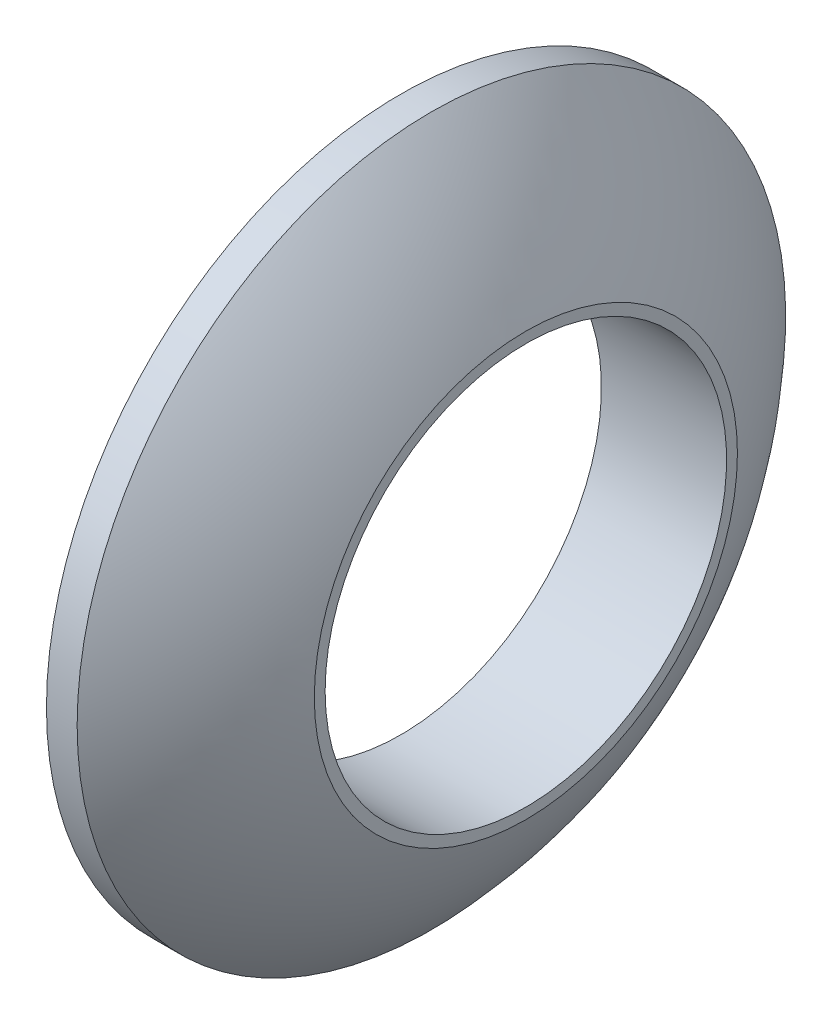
from build123d import *


with BuildPart() as part:
    # Esquisse1 → R_volution1 (revolve)
    with BuildSketch(Plane.XY, mode=Mode.PRIVATE) as r_volution1_sk:
        with BuildLine():
            Line((0, 8.5), (0, 15))
            Line((0, 15), (1.3, 15))
            ThreePointArc((1.3, 15), (3.550439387, 12.144988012), (5.3, 8.958358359))
            Line((5.3, 8.958358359), (5.3, 8.5))
            Line((5.3, 8.5), (0, 8.5))
        make_face()
    revolve(r_volution1_sk.sketch.rotate(Axis((-22.950664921, 0, 0), (1, 0, 0)), 90), axis=Axis((-22.950664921, 0, 0), (1, 0, 0)))


solid = part.part
